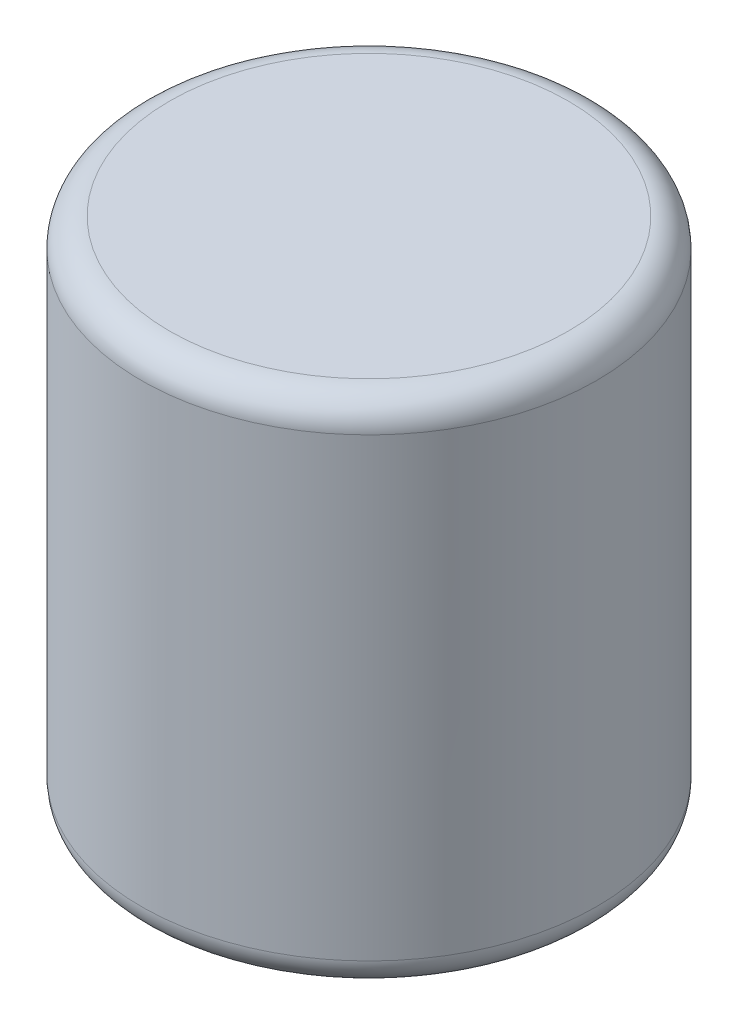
ISO-10303-21;
HEADER;
FILE_DESCRIPTION(('STEP AP214'),'2;1');
FILE_NAME('part.step','',(''),(''),'','','');
FILE_SCHEMA(('AUTOMOTIVE_DESIGN { 1 0 10303 214 1 1 1 1 }'));
ENDSEC;
DATA;
#1=APPLICATION_CONTEXT('core data for automotive mechanical design processes');
#2=APPLICATION_PROTOCOL_DEFINITION('international standard','automotive_design',2000,#1);
#3=PRODUCT_CONTEXT('',#1,'mechanical');
#4=PRODUCT('Part','Part','',(#3));
#5=PRODUCT_RELATED_PRODUCT_CATEGORY('part','',(#4));
#6=PRODUCT_DEFINITION_FORMATION('','',#4);
#7=PRODUCT_DEFINITION_CONTEXT('part definition',#1,'design');
#8=PRODUCT_DEFINITION('design','',#6,#7);
#9=PRODUCT_DEFINITION_SHAPE('','',#8);
#10=(LENGTH_UNIT() NAMED_UNIT(*) SI_UNIT(.MILLI.,.METRE.));
#11=(NAMED_UNIT(*) PLANE_ANGLE_UNIT() SI_UNIT($,.RADIAN.));
#12=(NAMED_UNIT(*) SI_UNIT($,.STERADIAN.) SOLID_ANGLE_UNIT());
#13=UNCERTAINTY_MEASURE_WITH_UNIT(LENGTH_MEASURE(1.E-05),#10,'distance_accuracy_value','');
#14=(GEOMETRIC_REPRESENTATION_CONTEXT(3) GLOBAL_UNCERTAINTY_ASSIGNED_CONTEXT((#13)) GLOBAL_UNIT_ASSIGNED_CONTEXT((#10,
#11,#12)) REPRESENTATION_CONTEXT('',''));
#15=CARTESIAN_POINT('',(0.,0.,0.));
#16=DIRECTION('',(0.,0.,1.));
#17=DIRECTION('',(1.,0.,0.));
#18=AXIS2_PLACEMENT_3D('',#15,#16,#17);
#19=CARTESIAN_POINT('',(0.,16.5,0.));
#20=DIRECTION('',(0.,-1.,0.));
#21=DIRECTION('',(1.,0.,0.));
#22=AXIS2_PLACEMENT_3D('',#19,#20,#21);
#23=PLANE('',#22);
#24=CARTESIAN_POINT('',(0.,16.5,0.));
#25=DIRECTION('',(0.,-1.,0.));
#26=DIRECTION('',(1.,0.,0.));
#27=AXIS2_PLACEMENT_3D('',#24,#25,#26);
#28=CIRCLE('',#27,5.5);
#29=CARTESIAN_POINT('',(5.5,16.5,0.));
#30=VERTEX_POINT('',#29);
#31=EDGE_CURVE('E54',#30,#30,#28,.T.);
#32=ORIENTED_EDGE('',*,*,#31,.T.);
#33=EDGE_LOOP('',(#32));
#34=FACE_BOUND('',#33,.T.);
#35=ADVANCED_FACE('F34',(#34),#23,.T.);
#36=CARTESIAN_POINT('',(0.,0.,0.));
#37=DIRECTION('',(0.,-1.,0.));
#38=DIRECTION('',(1.,0.,0.));
#39=AXIS2_PLACEMENT_3D('',#36,#37,#38);
#40=CYLINDRICAL_SURFACE('',#39,5.5);
#41=CARTESIAN_POINT('',(0.,15.25,0.));
#42=DIRECTION('',(0.,-1.,0.));
#43=DIRECTION('',(1.,0.,0.));
#44=AXIS2_PLACEMENT_3D('',#41,#42,#43);
#45=CIRCLE('',#44,5.5);
#46=CARTESIAN_POINT('',(5.5,15.25,0.));
#47=VERTEX_POINT('',#46);
#48=EDGE_CURVE('E57',#47,#47,#45,.T.);
#49=ORIENTED_EDGE('',*,*,#48,.T.);
#50=EDGE_LOOP('',(#49));
#51=FACE_BOUND('',#50,.T.);
#52=ORIENTED_EDGE('',*,*,#31,.F.);
#53=EDGE_LOOP('',(#52));
#54=FACE_BOUND('',#53,.T.);
#55=ADVANCED_FACE('F96',(#51,#54),#40,.F.);
#56=CARTESIAN_POINT('',(5.5,15.25,0.));
#57=DIRECTION('',(0.,-1.,0.));
#58=DIRECTION('',(1.,0.,0.));
#59=AXIS2_PLACEMENT_3D('',#56,#57,#58);
#60=PLANE('',#59);
#61=CARTESIAN_POINT('',(0.,15.25,0.));
#62=DIRECTION('',(0.,-1.,0.));
#63=DIRECTION('',(1.,0.,0.));
#64=AXIS2_PLACEMENT_3D('',#61,#62,#63);
#65=CIRCLE('',#64,6.2);
#66=CARTESIAN_POINT('',(6.2,15.25,0.));
#67=VERTEX_POINT('',#66);
#68=EDGE_CURVE('E60',#67,#67,#65,.T.);
#69=ORIENTED_EDGE('',*,*,#68,.T.);
#70=EDGE_LOOP('',(#69));
#71=FACE_BOUND('',#70,.T.);
#72=ORIENTED_EDGE('',*,*,#48,.F.);
#73=EDGE_LOOP('',(#72));
#74=FACE_BOUND('',#73,.T.);
#75=ADVANCED_FACE('F102',(#71,#74),#60,.T.);
#76=CARTESIAN_POINT('',(0.,0.,0.));
#77=DIRECTION('',(0.,-1.,0.));
#78=DIRECTION('',(1.,0.,0.));
#79=AXIS2_PLACEMENT_3D('',#76,#77,#78);
#80=CYLINDRICAL_SURFACE('',#79,6.2);
#81=CARTESIAN_POINT('',(0.,14.5,0.));
#82=DIRECTION('',(0.,-1.,0.));
#83=DIRECTION('',(1.,0.,0.));
#84=AXIS2_PLACEMENT_3D('',#81,#82,#83);
#85=CIRCLE('',#84,6.2);
#86=CARTESIAN_POINT('',(6.2,14.5,0.));
#87=VERTEX_POINT('',#86);
#88=EDGE_CURVE('E63',#87,#87,#85,.T.);
#89=ORIENTED_EDGE('',*,*,#88,.T.);
#90=EDGE_LOOP('',(#89));
#91=FACE_BOUND('',#90,.T.);
#92=ORIENTED_EDGE('',*,*,#68,.F.);
#93=EDGE_LOOP('',(#92));
#94=FACE_BOUND('',#93,.T.);
#95=ADVANCED_FACE('F165',(#91,#94),#80,.F.);
#96=CARTESIAN_POINT('',(6.2,14.5,0.));
#97=DIRECTION('',(0.,-1.,0.));
#98=DIRECTION('',(1.,0.,0.));
#99=AXIS2_PLACEMENT_3D('',#96,#97,#98);
#100=PLANE('',#99);
#101=CARTESIAN_POINT('',(0.,14.5,0.));
#102=DIRECTION('',(0.,-1.,0.));
#103=DIRECTION('',(1.,0.,0.));
#104=AXIS2_PLACEMENT_3D('',#101,#102,#103);
#105=CIRCLE('',#104,6.5);
#106=CARTESIAN_POINT('',(6.5,14.5,0.));
#107=VERTEX_POINT('',#106);
#108=EDGE_CURVE('E66',#107,#107,#105,.T.);
#109=ORIENTED_EDGE('',*,*,#108,.T.);
#110=EDGE_LOOP('',(#109));
#111=FACE_BOUND('',#110,.T.);
#112=ORIENTED_EDGE('',*,*,#88,.F.);
#113=EDGE_LOOP('',(#112));
#114=FACE_BOUND('',#113,.T.);
#115=ADVANCED_FACE('F155',(#111,#114),#100,.T.);
#116=CARTESIAN_POINT('',(0.,0.,0.));
#117=DIRECTION('',(0.,-1.,0.));
#118=DIRECTION('',(1.,0.,0.));
#119=AXIS2_PLACEMENT_3D('',#116,#117,#118);
#120=CYLINDRICAL_SURFACE('',#119,6.5);
#121=CARTESIAN_POINT('',(0.,0.75,0.));
#122=DIRECTION('',(0.,-1.,0.));
#123=DIRECTION('',(1.,0.,0.));
#124=AXIS2_PLACEMENT_3D('',#121,#122,#123);
#125=CIRCLE('',#124,6.5);
#126=CARTESIAN_POINT('',(6.5,0.75,0.));
#127=VERTEX_POINT('',#126);
#128=EDGE_CURVE('E69',#127,#127,#125,.T.);
#129=ORIENTED_EDGE('',*,*,#128,.T.);
#130=EDGE_LOOP('',(#129));
#131=FACE_BOUND('',#130,.T.);
#132=ORIENTED_EDGE('',*,*,#108,.F.);
#133=EDGE_LOOP('',(#132));
#134=FACE_BOUND('',#133,.T.);
#135=ADVANCED_FACE('F145',(#131,#134),#120,.F.);
#136=CARTESIAN_POINT('',(6.5,0.75,0.));
#137=DIRECTION('',(0.,1.,0.));
#138=DIRECTION('',(-1.,0.,0.));
#139=AXIS2_PLACEMENT_3D('',#136,#137,#138);
#140=PLANE('',#139);
#141=CARTESIAN_POINT('',(0.,0.75,0.));
#142=DIRECTION('',(0.,-1.,0.));
#143=DIRECTION('',(1.,0.,0.));
#144=AXIS2_PLACEMENT_3D('',#141,#142,#143);
#145=CIRCLE('',#144,6.2);
#146=CARTESIAN_POINT('',(6.2,0.75,0.));
#147=VERTEX_POINT('',#146);
#148=EDGE_CURVE('E72',#147,#147,#145,.T.);
#149=ORIENTED_EDGE('',*,*,#148,.T.);
#150=EDGE_LOOP('',(#149));
#151=FACE_BOUND('',#150,.T.);
#152=ORIENTED_EDGE('',*,*,#128,.F.);
#153=EDGE_LOOP('',(#152));
#154=FACE_BOUND('',#153,.T.);
#155=ADVANCED_FACE('F93',(#151,#154),#140,.T.);
#156=CARTESIAN_POINT('',(0.,0.,0.));
#157=DIRECTION('',(0.,-1.,0.));
#158=DIRECTION('',(1.,0.,0.));
#159=AXIS2_PLACEMENT_3D('',#156,#157,#158);
#160=CYLINDRICAL_SURFACE('',#159,6.2);
#161=CARTESIAN_POINT('',(0.,0.,0.));
#162=DIRECTION('',(0.,-1.,0.));
#163=DIRECTION('',(1.,0.,0.));
#164=AXIS2_PLACEMENT_3D('',#161,#162,#163);
#165=CIRCLE('',#164,6.2);
#166=CARTESIAN_POINT('',(6.2,0.,0.));
#167=VERTEX_POINT('',#166);
#168=EDGE_CURVE('E75',#167,#167,#165,.T.);
#169=ORIENTED_EDGE('',*,*,#168,.T.);
#170=EDGE_LOOP('',(#169));
#171=FACE_BOUND('',#170,.T.);
#172=ORIENTED_EDGE('',*,*,#148,.F.);
#173=EDGE_LOOP('',(#172));
#174=FACE_BOUND('',#173,.T.);
#175=ADVANCED_FACE('F79',(#171,#174),#160,.F.);
#176=CARTESIAN_POINT('',(6.2,0.,0.));
#177=DIRECTION('',(0.,-1.,0.));
#178=DIRECTION('',(1.,0.,0.));
#179=AXIS2_PLACEMENT_3D('',#176,#177,#178);
#180=PLANE('',#179);
#181=CARTESIAN_POINT('',(0.,0.,0.));
#182=DIRECTION('',(0.,-1.,0.));
#183=DIRECTION('',(1.,0.,0.));
#184=AXIS2_PLACEMENT_3D('',#181,#182,#183);
#185=CIRCLE('',#184,7.);
#186=CARTESIAN_POINT('',(7.,0.,0.));
#187=VERTEX_POINT('',#186);
#188=EDGE_CURVE('E49',#187,#187,#185,.T.);
#189=ORIENTED_EDGE('',*,*,#188,.T.);
#190=EDGE_LOOP('',(#189));
#191=FACE_BOUND('',#190,.T.);
#192=ORIENTED_EDGE('',*,*,#168,.F.);
#193=EDGE_LOOP('',(#192));
#194=FACE_BOUND('',#193,.T.);
#195=ADVANCED_FACE('F82',(#191,#194),#180,.T.);
#196=CARTESIAN_POINT('',(0.,0.,0.));
#197=DIRECTION('',(0.,-1.,0.));
#198=DIRECTION('',(1.,0.,0.));
#199=AXIS2_PLACEMENT_3D('',#196,#197,#198);
#200=CYLINDRICAL_SURFACE('',#199,8.);
#201=CARTESIAN_POINT('',(0.,1.,0.));
#202=DIRECTION('',(0.,-1.,0.));
#203=DIRECTION('',(1.,0.,0.));
#204=AXIS2_PLACEMENT_3D('',#201,#202,#203);
#205=CIRCLE('',#204,8.);
#206=CARTESIAN_POINT('',(8.,1.,0.));
#207=VERTEX_POINT('',#206);
#208=EDGE_CURVE('E41',#207,#207,#205,.F.);
#209=ORIENTED_EDGE('',*,*,#208,.T.);
#210=EDGE_LOOP('',(#209));
#211=FACE_BOUND('',#210,.T.);
#212=CARTESIAN_POINT('',(0.,17.,0.));
#213=DIRECTION('',(0.,1.,0.));
#214=DIRECTION('',(-1.,0.,0.));
#215=AXIS2_PLACEMENT_3D('',#212,#213,#214);
#216=CIRCLE('',#215,8.);
#217=CARTESIAN_POINT('',(-8.,17.,0.));
#218=VERTEX_POINT('',#217);
#219=EDGE_CURVE('E45',#218,#218,#216,.F.);
#220=ORIENTED_EDGE('',*,*,#219,.T.);
#221=EDGE_LOOP('',(#220));
#222=FACE_BOUND('',#221,.T.);
#223=ADVANCED_FACE('F84',(#211,#222),#200,.T.);
#224=CARTESIAN_POINT('',(8.,18.,0.));
#225=DIRECTION('',(0.,1.,0.));
#226=DIRECTION('',(-1.,0.,0.));
#227=AXIS2_PLACEMENT_3D('',#224,#225,#226);
#228=PLANE('',#227);
#229=CARTESIAN_POINT('',(0.,18.,0.));
#230=DIRECTION('',(0.,1.,0.));
#231=DIRECTION('',(-1.,0.,0.));
#232=AXIS2_PLACEMENT_3D('',#229,#230,#231);
#233=CIRCLE('',#232,7.);
#234=CARTESIAN_POINT('',(-7.,18.,0.));
#235=VERTEX_POINT('',#234);
#236=EDGE_CURVE('E11',#235,#235,#233,.T.);
#237=ORIENTED_EDGE('',*,*,#236,.T.);
#238=EDGE_LOOP('',(#237));
#239=FACE_BOUND('',#238,.T.);
#240=ADVANCED_FACE('F91',(#239),#228,.T.);
#241=CARTESIAN_POINT('',(0.,1.,0.));
#242=DIRECTION('',(0.,-1.,0.));
#243=DIRECTION('',(1.,0.,0.));
#244=AXIS2_PLACEMENT_3D('',#241,#242,#243);
#245=TOROIDAL_SURFACE('',#244,7.,1.);
#246=ORIENTED_EDGE('',*,*,#208,.F.);
#247=EDGE_LOOP('',(#246));
#248=FACE_BOUND('',#247,.T.);
#249=ORIENTED_EDGE('',*,*,#188,.F.);
#250=EDGE_LOOP('',(#249));
#251=FACE_BOUND('',#250,.T.);
#252=ADVANCED_FACE('F106',(#248,#251),#245,.T.);
#253=CARTESIAN_POINT('',(0.,17.,0.));
#254=DIRECTION('',(0.,1.,0.));
#255=DIRECTION('',(-1.,0.,0.));
#256=AXIS2_PLACEMENT_3D('',#253,#254,#255);
#257=TOROIDAL_SURFACE('',#256,7.,1.);
#258=ORIENTED_EDGE('',*,*,#236,.F.);
#259=EDGE_LOOP('',(#258));
#260=FACE_BOUND('',#259,.T.);
#261=ORIENTED_EDGE('',*,*,#219,.F.);
#262=EDGE_LOOP('',(#261));
#263=FACE_BOUND('',#262,.T.);
#264=ADVANCED_FACE('F36',(#260,#263),#257,.T.);
#265=CLOSED_SHELL('',(#35,#55,#75,#95,#115,#135,#155,#175,#195,#223,#240,#252,#264));
#266=MANIFOLD_SOLID_BREP('B2',#265);
#267=ADVANCED_BREP_SHAPE_REPRESENTATION('',(#18,#266),#14);
#268=SHAPE_DEFINITION_REPRESENTATION(#9,#267);
ENDSEC;
END-ISO-10303-21;
